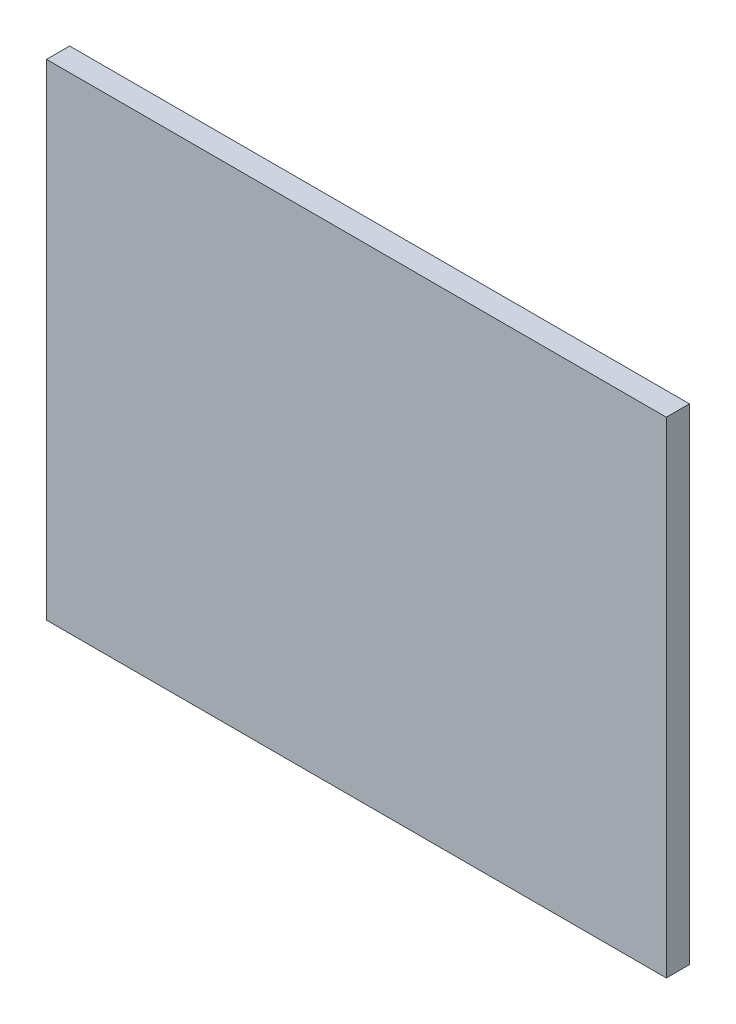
ISO-10303-21;
HEADER;
FILE_DESCRIPTION(('STEP AP214'),'2;1');
FILE_NAME('part.step','',(''),(''),'','','');
FILE_SCHEMA(('AUTOMOTIVE_DESIGN { 1 0 10303 214 1 1 1 1 }'));
ENDSEC;
DATA;
#1=APPLICATION_CONTEXT('core data for automotive mechanical design processes');
#2=APPLICATION_PROTOCOL_DEFINITION('international standard','automotive_design',2000,#1);
#3=PRODUCT_CONTEXT('',#1,'mechanical');
#4=PRODUCT('Part','Part','',(#3));
#5=PRODUCT_RELATED_PRODUCT_CATEGORY('part','',(#4));
#6=PRODUCT_DEFINITION_FORMATION('','',#4);
#7=PRODUCT_DEFINITION_CONTEXT('part definition',#1,'design');
#8=PRODUCT_DEFINITION('design','',#6,#7);
#9=PRODUCT_DEFINITION_SHAPE('','',#8);
#10=(LENGTH_UNIT() NAMED_UNIT(*) SI_UNIT(.MILLI.,.METRE.));
#11=(NAMED_UNIT(*) PLANE_ANGLE_UNIT() SI_UNIT($,.RADIAN.));
#12=(NAMED_UNIT(*) SI_UNIT($,.STERADIAN.) SOLID_ANGLE_UNIT());
#13=UNCERTAINTY_MEASURE_WITH_UNIT(LENGTH_MEASURE(1.E-05),#10,'distance_accuracy_value','');
#14=(GEOMETRIC_REPRESENTATION_CONTEXT(3) GLOBAL_UNCERTAINTY_ASSIGNED_CONTEXT((#13)) GLOBAL_UNIT_ASSIGNED_CONTEXT((#10,
#11,#12)) REPRESENTATION_CONTEXT('',''));
#15=CARTESIAN_POINT('',(0.,0.,0.));
#16=DIRECTION('',(0.,0.,1.));
#17=DIRECTION('',(1.,0.,0.));
#18=AXIS2_PLACEMENT_3D('',#15,#16,#17);
#19=CARTESIAN_POINT('',(-42.545,66.675,3.175));
#20=DIRECTION('',(1.,0.,0.));
#21=DIRECTION('',(0.,0.,-1.));
#22=AXIS2_PLACEMENT_3D('',#19,#20,#21);
#23=PLANE('',#22);
#24=DIRECTION('',(0.,-1.,0.));
#25=VECTOR('',#24,1.);
#26=CARTESIAN_POINT('',(-42.545,66.675,0.));
#27=LINE('',#26,#25);
#28=CARTESIAN_POINT('',(-42.545,66.675,0.));
#29=VERTEX_POINT('',#28);
#30=CARTESIAN_POINT('',(-42.545,0.,0.));
#31=VERTEX_POINT('',#30);
#32=EDGE_CURVE('E93',#29,#31,#27,.T.);
#33=ORIENTED_EDGE('',*,*,#32,.T.);
#34=DIRECTION('',(0.,0.,-1.));
#35=VECTOR('',#34,1.);
#36=CARTESIAN_POINT('',(-42.545,0.,3.175));
#37=LINE('',#36,#35);
#38=CARTESIAN_POINT('',(-42.545,0.,3.175));
#39=VERTEX_POINT('',#38);
#40=EDGE_CURVE('E11',#39,#31,#37,.T.);
#41=ORIENTED_EDGE('',*,*,#40,.F.);
#42=DIRECTION('',(0.,-1.,0.));
#43=VECTOR('',#42,1.);
#44=CARTESIAN_POINT('',(-42.545,66.675,3.175));
#45=LINE('',#44,#43);
#46=CARTESIAN_POINT('',(-42.545,66.675,3.175));
#47=VERTEX_POINT('',#46);
#48=EDGE_CURVE('E81',#47,#39,#45,.T.);
#49=ORIENTED_EDGE('',*,*,#48,.F.);
#50=DIRECTION('',(0.,0.,-1.));
#51=VECTOR('',#50,1.);
#52=CARTESIAN_POINT('',(-42.545,66.675,3.175));
#53=LINE('',#52,#51);
#54=EDGE_CURVE('E89',#47,#29,#53,.T.);
#55=ORIENTED_EDGE('',*,*,#54,.T.);
#56=EDGE_LOOP('',(#33,#41,#49,#55));
#57=FACE_BOUND('',#56,.T.);
#58=ADVANCED_FACE('F30',(#57),#23,.F.);
#59=CARTESIAN_POINT('',(-42.545,0.,3.175));
#60=DIRECTION('',(0.,1.,0.));
#61=DIRECTION('',(0.,0.,1.));
#62=AXIS2_PLACEMENT_3D('',#59,#60,#61);
#63=PLANE('',#62);
#64=DIRECTION('',(1.,0.,0.));
#65=VECTOR('',#64,1.);
#66=CARTESIAN_POINT('',(-42.545,0.,0.));
#67=LINE('',#66,#65);
#68=CARTESIAN_POINT('',(42.545,0.,0.));
#69=VERTEX_POINT('',#68);
#70=EDGE_CURVE('E85',#31,#69,#67,.T.);
#71=ORIENTED_EDGE('',*,*,#70,.T.);
#72=DIRECTION('',(0.,0.,-1.));
#73=VECTOR('',#72,1.);
#74=CARTESIAN_POINT('',(42.545,0.,3.175));
#75=LINE('',#74,#73);
#76=CARTESIAN_POINT('',(42.545,0.,3.175));
#77=VERTEX_POINT('',#76);
#78=EDGE_CURVE('E38',#77,#69,#75,.T.);
#79=ORIENTED_EDGE('',*,*,#78,.F.);
#80=DIRECTION('',(1.,0.,0.));
#81=VECTOR('',#80,1.);
#82=CARTESIAN_POINT('',(-42.545,0.,3.175));
#83=LINE('',#82,#81);
#84=EDGE_CURVE('E76',#39,#77,#83,.T.);
#85=ORIENTED_EDGE('',*,*,#84,.F.);
#86=ORIENTED_EDGE('',*,*,#40,.T.);
#87=EDGE_LOOP('',(#71,#79,#85,#86));
#88=FACE_BOUND('',#87,.T.);
#89=ADVANCED_FACE('F84',(#88),#63,.F.);
#90=CARTESIAN_POINT('',(42.545,66.675,3.175));
#91=DIRECTION('',(-1.,0.,0.));
#92=DIRECTION('',(0.,0.,1.));
#93=AXIS2_PLACEMENT_3D('',#90,#91,#92);
#94=PLANE('',#93);
#95=DIRECTION('',(0.,1.,0.));
#96=VECTOR('',#95,1.);
#97=CARTESIAN_POINT('',(42.545,66.675,0.));
#98=LINE('',#97,#96);
#99=CARTESIAN_POINT('',(42.545,66.675,0.));
#100=VERTEX_POINT('',#99);
#101=EDGE_CURVE('E63',#69,#100,#98,.T.);
#102=ORIENTED_EDGE('',*,*,#101,.T.);
#103=DIRECTION('',(0.,0.,-1.));
#104=VECTOR('',#103,1.);
#105=CARTESIAN_POINT('',(42.545,66.675,3.175));
#106=LINE('',#105,#104);
#107=CARTESIAN_POINT('',(42.545,66.675,3.175));
#108=VERTEX_POINT('',#107);
#109=EDGE_CURVE('E86',#108,#100,#106,.T.);
#110=ORIENTED_EDGE('',*,*,#109,.F.);
#111=DIRECTION('',(0.,1.,0.));
#112=VECTOR('',#111,1.);
#113=CARTESIAN_POINT('',(42.545,66.675,3.175));
#114=LINE('',#113,#112);
#115=EDGE_CURVE('E79',#77,#108,#114,.T.);
#116=ORIENTED_EDGE('',*,*,#115,.F.);
#117=ORIENTED_EDGE('',*,*,#78,.T.);
#118=EDGE_LOOP('',(#102,#110,#116,#117));
#119=FACE_BOUND('',#118,.T.);
#120=ADVANCED_FACE('F87',(#119),#94,.F.);
#121=CARTESIAN_POINT('',(-42.545,66.675,3.175));
#122=DIRECTION('',(0.,-1.,0.));
#123=DIRECTION('',(1.,0.,0.));
#124=AXIS2_PLACEMENT_3D('',#121,#122,#123);
#125=PLANE('',#124);
#126=DIRECTION('',(-1.,0.,0.));
#127=VECTOR('',#126,1.);
#128=CARTESIAN_POINT('',(-42.545,66.675,0.));
#129=LINE('',#128,#127);
#130=EDGE_CURVE('E69',#100,#29,#129,.T.);
#131=ORIENTED_EDGE('',*,*,#130,.T.);
#132=ORIENTED_EDGE('',*,*,#54,.F.);
#133=DIRECTION('',(-1.,0.,0.));
#134=VECTOR('',#133,1.);
#135=CARTESIAN_POINT('',(-42.545,66.675,3.175));
#136=LINE('',#135,#134);
#137=EDGE_CURVE('E46',#108,#47,#136,.T.);
#138=ORIENTED_EDGE('',*,*,#137,.F.);
#139=ORIENTED_EDGE('',*,*,#109,.T.);
#140=EDGE_LOOP('',(#131,#132,#138,#139));
#141=FACE_BOUND('',#140,.T.);
#142=ADVANCED_FACE('F100',(#141),#125,.F.);
#143=CARTESIAN_POINT('',(-42.545,0.,3.175));
#144=DIRECTION('',(0.,0.,1.));
#145=DIRECTION('',(1.,0.,0.));
#146=AXIS2_PLACEMENT_3D('',#143,#144,#145);
#147=PLANE('',#146);
#148=ORIENTED_EDGE('',*,*,#48,.T.);
#149=ORIENTED_EDGE('',*,*,#84,.T.);
#150=ORIENTED_EDGE('',*,*,#115,.T.);
#151=ORIENTED_EDGE('',*,*,#137,.T.);
#152=EDGE_LOOP('',(#148,#149,#150,#151));
#153=FACE_BOUND('',#152,.T.);
#154=ADVANCED_FACE('F77',(#153),#147,.T.);
#155=CARTESIAN_POINT('',(-42.545,0.,0.));
#156=DIRECTION('',(0.,0.,1.));
#157=DIRECTION('',(1.,0.,0.));
#158=AXIS2_PLACEMENT_3D('',#155,#156,#157);
#159=PLANE('',#158);
#160=ORIENTED_EDGE('',*,*,#32,.F.);
#161=ORIENTED_EDGE('',*,*,#130,.F.);
#162=ORIENTED_EDGE('',*,*,#101,.F.);
#163=ORIENTED_EDGE('',*,*,#70,.F.);
#164=EDGE_LOOP('',(#160,#161,#162,#163));
#165=FACE_BOUND('',#164,.T.);
#166=ADVANCED_FACE('F103',(#165),#159,.F.);
#167=CLOSED_SHELL('',(#58,#89,#120,#142,#154,#166));
#168=MANIFOLD_SOLID_BREP('B2',#167);
#169=ADVANCED_BREP_SHAPE_REPRESENTATION('',(#18,#168),#14);
#170=SHAPE_DEFINITION_REPRESENTATION(#9,#169);
ENDSEC;
END-ISO-10303-21;
